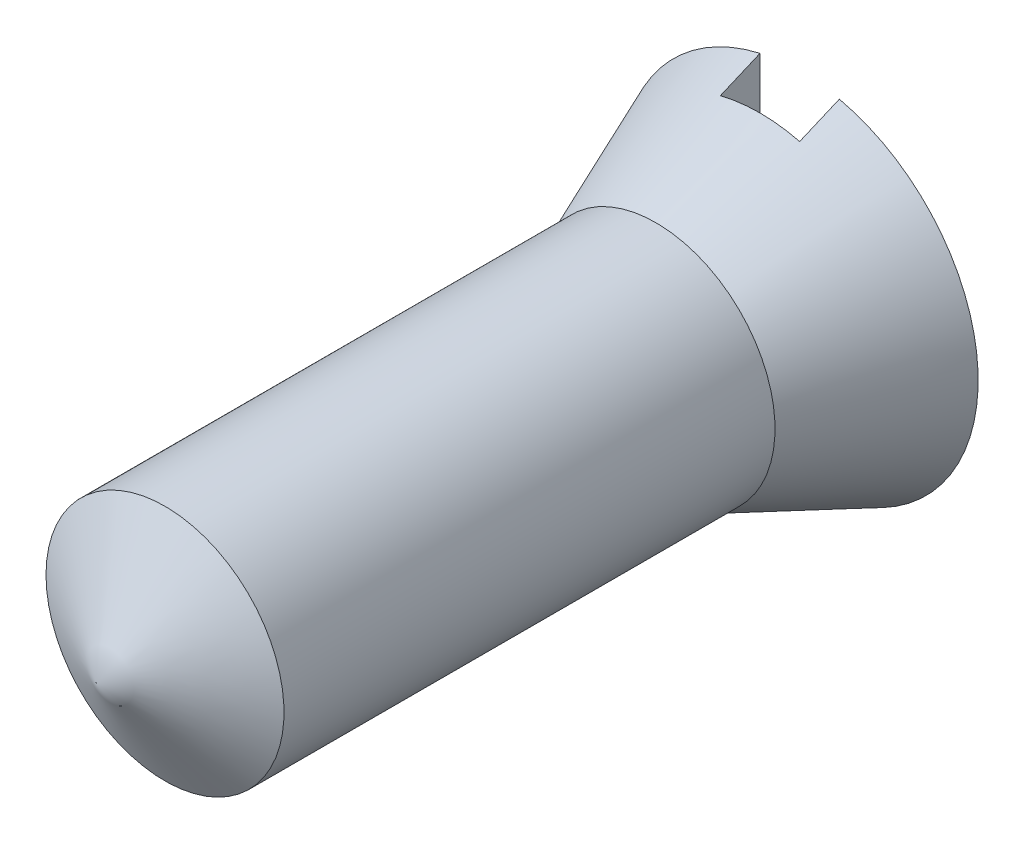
ISO-10303-21;
HEADER;
FILE_DESCRIPTION(('STEP AP214'),'2;1');
FILE_NAME('part.step','',(''),(''),'','','');
FILE_SCHEMA(('AUTOMOTIVE_DESIGN { 1 0 10303 214 1 1 1 1 }'));
ENDSEC;
DATA;
#1=APPLICATION_CONTEXT('core data for automotive mechanical design processes');
#2=APPLICATION_PROTOCOL_DEFINITION('international standard','automotive_design',2000,#1);
#3=PRODUCT_CONTEXT('',#1,'mechanical');
#4=PRODUCT('Part','Part','',(#3));
#5=PRODUCT_RELATED_PRODUCT_CATEGORY('part','',(#4));
#6=PRODUCT_DEFINITION_FORMATION('','',#4);
#7=PRODUCT_DEFINITION_CONTEXT('part definition',#1,'design');
#8=PRODUCT_DEFINITION('design','',#6,#7);
#9=PRODUCT_DEFINITION_SHAPE('','',#8);
#10=(LENGTH_UNIT() NAMED_UNIT(*) SI_UNIT(.MILLI.,.METRE.));
#11=(NAMED_UNIT(*) PLANE_ANGLE_UNIT() SI_UNIT($,.RADIAN.));
#12=(NAMED_UNIT(*) SI_UNIT($,.STERADIAN.) SOLID_ANGLE_UNIT());
#13=UNCERTAINTY_MEASURE_WITH_UNIT(LENGTH_MEASURE(1.E-05),#10,'distance_accuracy_value','');
#14=(GEOMETRIC_REPRESENTATION_CONTEXT(3) GLOBAL_UNCERTAINTY_ASSIGNED_CONTEXT((#13)) GLOBAL_UNIT_ASSIGNED_CONTEXT((#10,
#11,#12)) REPRESENTATION_CONTEXT('',''));
#15=CARTESIAN_POINT('',(0.,0.,0.));
#16=DIRECTION('',(0.,0.,1.));
#17=DIRECTION('',(1.,0.,0.));
#18=AXIS2_PLACEMENT_3D('',#15,#16,#17);
#19=CARTESIAN_POINT('',(0.,0.,-17.7320508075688));
#20=DIRECTION('',(0.,0.,0.999999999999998));
#21=DIRECTION('',(1.,0.,0.));
#22=AXIS2_PLACEMENT_3D('',#19,#20,#21);
#23=PLANE('',#22);
#24=CARTESIAN_POINT('',(0.,0.,-17.7320508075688));
#25=DIRECTION('',(0.,0.,-0.999999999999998));
#26=DIRECTION('',(-1.,0.,0.));
#27=AXIS2_PLACEMENT_3D('',#24,#25,#26);
#28=CIRCLE('',#27,4.5);
#29=CARTESIAN_POINT('',(-1.00000000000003,-4.38748219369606,-17.7320508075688));
#30=VERTEX_POINT('',#29);
#31=CARTESIAN_POINT('',(-1.00000000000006,4.38748219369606,-17.7320508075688));
#32=VERTEX_POINT('',#31);
#33=EDGE_CURVE('E94',#30,#32,#28,.T.);
#34=ORIENTED_EDGE('',*,*,#33,.T.);
#35=DIRECTION('',(0.,1.,0.));
#36=VECTOR('',#35,1.);
#37=CARTESIAN_POINT('',(-1.00000000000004,-5.22642009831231,-17.7320508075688));
#38=LINE('',#37,#36);
#39=EDGE_CURVE('E83',#30,#32,#38,.T.);
#40=ORIENTED_EDGE('',*,*,#39,.F.);
#41=EDGE_LOOP('',(#34,#40));
#42=FACE_BOUND('',#41,.T.);
#43=ADVANCED_FACE('F34',(#42),#23,.F.);
#44=CARTESIAN_POINT('',(0.,0.,0.));
#45=DIRECTION('',(0.,0.,-0.999999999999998));
#46=DIRECTION('',(-1.,0.,0.));
#47=AXIS2_PLACEMENT_3D('',#44,#45,#46);
#48=CONICAL_SURFACE('',#47,0.,1.0471975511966);
#49=CARTESIAN_POINT('',(0.,0.,-1.73205080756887));
#50=DIRECTION('',(0.,0.,-0.999999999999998));
#51=DIRECTION('',(-1.,0.,0.));
#52=AXIS2_PLACEMENT_3D('',#49,#50,#51);
#53=CIRCLE('',#52,3.);
#54=CARTESIAN_POINT('',(-3.,0.,-1.73205080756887));
#55=VERTEX_POINT('',#54);
#56=EDGE_CURVE('E106',#55,#55,#53,.T.);
#57=ORIENTED_EDGE('',*,*,#56,.F.);
#58=EDGE_LOOP('',(#57));
#59=FACE_BOUND('',#58,.T.);
#60=CARTESIAN_POINT('',(0.,0.,0.));
#61=VERTEX_POINT('',#60);
#62=VERTEX_LOOP('',#61);
#63=FACE_BOUND('',#62,.T.);
#64=ADVANCED_FACE('F36',(#59,#63),#48,.T.);
#65=CARTESIAN_POINT('',(0.99999999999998,4.38748219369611,-17.7320508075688));
#66=VERTEX_POINT('',#65);
#67=CARTESIAN_POINT('',(1.,-4.38748219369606,-17.7320508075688));
#68=VERTEX_POINT('',#67);
#69=EDGE_CURVE('E100',#66,#68,#28,.T.);
#70=ORIENTED_EDGE('',*,*,#69,.T.);
#71=DIRECTION('',(0.,-1.,0.));
#72=VECTOR('',#71,1.);
#73=CARTESIAN_POINT('',(0.999999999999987,-5.22642009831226,-17.7320508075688));
#74=LINE('',#73,#72);
#75=EDGE_CURVE('E95',#66,#68,#74,.T.);
#76=ORIENTED_EDGE('',*,*,#75,.F.);
#77=EDGE_LOOP('',(#70,#76));
#78=FACE_BOUND('',#77,.T.);
#79=ADVANCED_FACE('F140',(#78),#23,.F.);
#80=CARTESIAN_POINT('',(0.,0.,-14.1107304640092));
#81=DIRECTION('',(0.,0.,-0.999999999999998));
#82=DIRECTION('',(-1.,0.,0.));
#83=AXIS2_PLACEMENT_3D('',#80,#81,#82);
#84=CONICAL_SURFACE('',#83,3.,0.392699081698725);
#85=CARTESIAN_POINT('',(0.,0.,-16.7320508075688));
#86=DIRECTION('',(0.,0.,0.999999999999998));
#87=DIRECTION('',(1.,0.,0.));
#88=AXIS2_PLACEMENT_3D('',#85,#86,#87);
#89=CIRCLE('',#88,4.0857864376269);
#90=CARTESIAN_POINT('',(0.999999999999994,3.96152127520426,-16.7320508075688));
#91=VERTEX_POINT('',#90);
#92=CARTESIAN_POINT('',(-1.00000000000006,3.96152127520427,-16.7320508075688));
#93=VERTEX_POINT('',#92);
#94=EDGE_CURVE('E89',#91,#93,#89,.T.);
#95=ORIENTED_EDGE('',*,*,#94,.T.);
#96=CARTESIAN_POINT('',(-1.00000000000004,1.60063772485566,-11.4245244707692));
#97=CARTESIAN_POINT('',(-1.00000000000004,1.65057142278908,-11.5267897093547));
#98=CARTESIAN_POINT('',(-1.00000000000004,1.69999701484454,-11.6293007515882));
#99=CARTESIAN_POINT('',(-1.00000000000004,1.79801494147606,-11.8347179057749));
#100=CARTESIAN_POINT('',(-1.00000000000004,1.84660729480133,-11.9376240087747));
#101=CARTESIAN_POINT('',(-1.00000000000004,1.99140591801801,-12.2467835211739));
#102=CARTESIAN_POINT('',(-1.00000000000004,2.08664025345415,-12.4534915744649));
#103=CARTESIAN_POINT('',(-1.00000000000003,2.27536549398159,-12.8676670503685));
#104=CARTESIAN_POINT('',(-1.00000000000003,2.36885661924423,-13.0751343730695));
#105=CARTESIAN_POINT('',(-1.00000000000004,2.55461331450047,-13.4906213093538));
#106=CARTESIAN_POINT('',(-1.00000000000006,2.64687885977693,-13.6986409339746));
#107=CARTESIAN_POINT('',(-1.00000000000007,2.84981541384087,-14.1588520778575));
#108=CARTESIAN_POINT('',(-1.00000000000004,2.96027771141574,-14.4111355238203));
#109=CARTESIAN_POINT('',(-1.00000000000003,3.18025742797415,-14.9161114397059));
#110=CARTESIAN_POINT('',(-1.00000000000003,3.28977485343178,-15.168803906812));
#111=CARTESIAN_POINT('',(-1.00000000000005,3.61730866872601,-15.9273692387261));
#112=CARTESIAN_POINT('',(-1.00000000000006,3.83428875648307,-16.4336893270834));
#113=CARTESIAN_POINT('',(-1.00000000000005,4.24781720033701,-17.4029614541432));
#114=CARTESIAN_POINT('',(-1.00000000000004,4.44450138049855,-17.8658556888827));
#115=CARTESIAN_POINT('',(-1.00000000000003,4.83694417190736,-18.7920365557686));
#116=CARTESIAN_POINT('',(-1.00000000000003,5.03270278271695,-19.2553231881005));
#117=CARTESIAN_POINT('',(-1.00000000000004,5.4235382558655,-20.1820819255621));
#118=CARTESIAN_POINT('',(-1.00000000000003,5.61861523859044,-20.6455539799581));
#119=CARTESIAN_POINT('',(-1.00000000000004,6.00828539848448,-21.5727001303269));
#120=CARTESIAN_POINT('',(-1.00000000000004,6.2028785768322,-22.0363742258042));
#121=CARTESIAN_POINT('',(-1.00000000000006,6.39731094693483,-22.5001155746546));
#122=B_SPLINE_CURVE_WITH_KNOTS('',3,(#96,#97,#98,#99,#100,#101,#102,#103,#104,#105,#106,#107,
#108,#109,#110,#111,#112,#113,#114,#115,#116,#117,#118,#119,#120,#121),.UNSPECIFIED.,.F.,.F.,(4,
2,2,2,2,2,2,2,2,2,2,2,4),(0.,0.341410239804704,0.682812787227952,1.36557309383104,
2.04824657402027,2.73093380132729,3.55715118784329,4.38336290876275,6.03591968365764,
7.54475991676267,9.05360086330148,10.5621602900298,12.0707160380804),.UNSPECIFIED.);
#123=EDGE_CURVE('E11',#93,#32,#122,.T.);
#124=ORIENTED_EDGE('',*,*,#123,.T.);
#125=ORIENTED_EDGE('',*,*,#33,.F.);
#126=CARTESIAN_POINT('',(-1.,-6.39731094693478,-22.5001155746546));
#127=CARTESIAN_POINT('',(-1.00000000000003,-6.20285005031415,-22.0363065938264));
#128=CARTESIAN_POINT('',(-1.00000000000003,-6.00822851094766,-21.5725647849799));
#129=CARTESIAN_POINT('',(-1.00000000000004,-5.61850468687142,-20.6452909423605));
#130=CARTESIAN_POINT('',(-1.00000000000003,-5.4234024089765,-20.181758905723));
#131=CARTESIAN_POINT('',(-1.00000000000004,-5.03256941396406,-19.2550078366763));
#132=CARTESIAN_POINT('',(-1.00000000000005,-4.8368387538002,-18.7917887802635));
#133=CARTESIAN_POINT('',(-1.00000000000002,-4.44445071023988,-17.8657350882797));
#134=CARTESIAN_POINT('',(-0.999999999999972,-4.24779331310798,-17.4029004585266));
#135=CARTESIAN_POINT('',(-0.999999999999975,-3.85308326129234,-16.4777469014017));
#136=CARTESIAN_POINT('',(-1.00000000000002,-3.65503041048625,-16.0154280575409));
#137=CARTESIAN_POINT('',(-1.00000000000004,-3.3563030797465,-15.3226703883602));
#138=CARTESIAN_POINT('',(-1.00000000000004,-3.25645449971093,-15.0918755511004));
#139=CARTESIAN_POINT('',(-1.00000000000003,-3.0560290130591,-14.6305998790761));
#140=CARTESIAN_POINT('',(-1.00000000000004,-2.95545210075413,-14.4001190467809));
#141=CARTESIAN_POINT('',(-1.00000000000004,-2.75331074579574,-13.939552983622));
#142=CARTESIAN_POINT('',(-1.00000000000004,-2.65174617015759,-13.7094678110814));
#143=CARTESIAN_POINT('',(-1.00000000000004,-2.44727167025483,-13.2499002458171));
#144=CARTESIAN_POINT('',(-1.00000000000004,-2.3443617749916,-13.020417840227));
#145=CARTESIAN_POINT('',(-1.00000000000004,-2.18851526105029,-12.6768478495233));
#146=CARTESIAN_POINT('',(-1.00000000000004,-2.136315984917,-12.5624259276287));
#147=CARTESIAN_POINT('',(-1.00000000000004,-2.03130559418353,-12.3338640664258));
#148=CARTESIAN_POINT('',(-1.00000000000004,-1.97849448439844,-12.2197241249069));
#149=CARTESIAN_POINT('',(-1.00000000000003,-1.87210843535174,-11.9917897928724));
#150=CARTESIAN_POINT('',(-1.00000000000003,-1.81853344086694,-11.8779954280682));
#151=CARTESIAN_POINT('',(-1.00000000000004,-1.71038916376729,-11.650876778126));
#152=CARTESIAN_POINT('',(-1.00000000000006,-1.65581985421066,-11.5375525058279));
#153=CARTESIAN_POINT('',(-1.00000000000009,-1.60063772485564,-11.4245244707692));
#154=B_SPLINE_CURVE_WITH_KNOTS('',3,(#126,#127,#128,#129,#130,#131,#132,#133,#134,#135,#136,
#137,#138,#139,#140,#141,#142,#143,#144,#145,#146,#147,#148,#149,#150,#151,#152,#153),
.UNSPECIFIED.,.F.,.F.,(4,2,2,2,2,2,2,2,2,2,2,2,2,4),(0.,1.50877597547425,3.01753068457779,
4.52615230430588,6.03479635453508,7.5436568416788,8.29805902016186,9.05246709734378,
9.80697819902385,10.561473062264,10.9387702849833,11.3160645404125,11.6933862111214,
12.0707181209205),.UNSPECIFIED.);
#155=CARTESIAN_POINT('',(-1.00000000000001,-3.96152127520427,-16.7320508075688));
#156=VERTEX_POINT('',#155);
#157=EDGE_CURVE('E80',#30,#156,#154,.T.);
#158=ORIENTED_EDGE('',*,*,#157,.T.);
#159=CARTESIAN_POINT('',(0.999999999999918,-3.96152127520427,-16.7320508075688));
#160=VERTEX_POINT('',#159);
#161=EDGE_CURVE('E104',#156,#160,#89,.T.);
#162=ORIENTED_EDGE('',*,*,#161,.T.);
#163=CARTESIAN_POINT('',(0.999999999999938,-1.60063772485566,-11.4245244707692));
#164=CARTESIAN_POINT('',(0.999999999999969,-1.6505714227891,-11.5267897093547));
#165=CARTESIAN_POINT('',(0.999999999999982,-1.69999701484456,-11.6293007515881));
#166=CARTESIAN_POINT('',(0.999999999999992,-1.79801494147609,-11.8347179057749));
#167=CARTESIAN_POINT('',(0.999999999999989,-1.84660729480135,-11.9376240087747));
#168=CARTESIAN_POINT('',(0.999999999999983,-1.99140591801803,-12.2467835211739));
#169=CARTESIAN_POINT('',(0.999999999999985,-2.08664025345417,-12.4534915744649));
#170=CARTESIAN_POINT('',(0.999999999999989,-2.27536549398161,-12.8676670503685));
#171=CARTESIAN_POINT('',(0.999999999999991,-2.36885661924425,-13.0751343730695));
#172=CARTESIAN_POINT('',(0.999999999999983,-2.55461331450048,-13.4906213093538));
#173=CARTESIAN_POINT('',(0.999999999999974,-2.64687885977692,-13.6986409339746));
#174=CARTESIAN_POINT('',(0.999999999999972,-2.84981541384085,-14.1588520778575));
#175=CARTESIAN_POINT('',(0.999999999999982,-2.96027771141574,-14.4111355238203));
#176=CARTESIAN_POINT('',(0.999999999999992,-3.18025742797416,-14.9161114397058));
#177=CARTESIAN_POINT('',(0.99999999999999,-3.28977485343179,-15.168803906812));
#178=CARTESIAN_POINT('',(0.999999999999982,-3.617308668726,-15.9273692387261));
#179=CARTESIAN_POINT('',(0.999999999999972,-3.83428875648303,-16.4336893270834));
#180=CARTESIAN_POINT('',(0.999999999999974,-4.24781720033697,-17.4029614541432));
#181=CARTESIAN_POINT('',(0.999999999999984,-4.44450138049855,-17.8658556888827));
#182=CARTESIAN_POINT('',(0.99999999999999,-4.83694417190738,-18.7920365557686));
#183=CARTESIAN_POINT('',(0.999999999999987,-5.03270278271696,-19.2553231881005));
#184=CARTESIAN_POINT('',(0.999999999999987,-5.4235382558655,-20.1820819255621));
#185=CARTESIAN_POINT('',(0.999999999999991,-5.61861523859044,-20.6455539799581));
#186=CARTESIAN_POINT('',(0.999999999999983,-6.00828539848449,-21.5727001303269));
#187=CARTESIAN_POINT('',(0.999999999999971,-6.20287857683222,-22.0363742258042));
#188=CARTESIAN_POINT('',(0.999999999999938,-6.39731094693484,-22.5001155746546));
#189=B_SPLINE_CURVE_WITH_KNOTS('',3,(#163,#164,#165,#166,#167,#168,#169,#170,#171,#172,#173,
#174,#175,#176,#177,#178,#179,#180,#181,#182,#183,#184,#185,#186,#187,#188),.UNSPECIFIED.,.F.,
.F.,(4,2,2,2,2,2,2,2,2,2,2,2,4),(0.,0.341410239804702,0.68281278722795,1.36557309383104,
2.04824657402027,2.73093380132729,3.55715118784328,4.38336290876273,6.03591968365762,
7.54475991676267,9.05360086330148,10.5621602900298,12.0707160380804),.UNSPECIFIED.);
#190=EDGE_CURVE('E90',#160,#68,#189,.T.);
#191=ORIENTED_EDGE('',*,*,#190,.T.);
#192=ORIENTED_EDGE('',*,*,#69,.F.);
#193=CARTESIAN_POINT('',(0.999999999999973,6.39731094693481,-22.5001155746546));
#194=CARTESIAN_POINT('',(0.999999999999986,6.20285005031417,-22.0363065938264));
#195=CARTESIAN_POINT('',(0.999999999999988,6.00822851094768,-21.5725647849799));
#196=CARTESIAN_POINT('',(0.999999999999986,5.61850468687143,-20.6452909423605));
#197=CARTESIAN_POINT('',(0.999999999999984,5.42340240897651,-20.181758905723));
#198=CARTESIAN_POINT('',(0.99999999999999,5.03256941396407,-19.2550078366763));
#199=CARTESIAN_POINT('',(1.,4.83683875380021,-18.7917887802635));
#200=CARTESIAN_POINT('',(0.999999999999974,4.44445071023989,-17.8657350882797));
#201=CARTESIAN_POINT('',(0.999999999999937,4.247793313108,-17.4029004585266));
#202=CARTESIAN_POINT('',(0.999999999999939,3.85308326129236,-16.4777469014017));
#203=CARTESIAN_POINT('',(0.999999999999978,3.65503041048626,-16.0154280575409));
#204=CARTESIAN_POINT('',(0.999999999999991,3.35630307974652,-15.3226703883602));
#205=CARTESIAN_POINT('',(0.999999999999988,3.25645449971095,-15.0918755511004));
#206=CARTESIAN_POINT('',(0.999999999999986,3.05602901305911,-14.6305998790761));
#207=CARTESIAN_POINT('',(0.999999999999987,2.95545210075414,-14.4001190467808));
#208=CARTESIAN_POINT('',(0.999999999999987,2.75331074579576,-13.939552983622));
#209=CARTESIAN_POINT('',(0.999999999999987,2.6517461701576,-13.7094678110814));
#210=CARTESIAN_POINT('',(0.999999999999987,2.44727167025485,-13.2499002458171));
#211=CARTESIAN_POINT('',(0.999999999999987,2.34436177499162,-13.020417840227));
#212=CARTESIAN_POINT('',(0.999999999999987,2.18851526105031,-12.6768478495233));
#213=CARTESIAN_POINT('',(0.999999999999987,2.13631598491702,-12.5624259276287));
#214=CARTESIAN_POINT('',(0.999999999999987,2.03130559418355,-12.3338640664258));
#215=CARTESIAN_POINT('',(0.999999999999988,1.97849448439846,-12.2197241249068));
#216=CARTESIAN_POINT('',(0.999999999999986,1.87210843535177,-11.9917897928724));
#217=CARTESIAN_POINT('',(0.999999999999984,1.81853344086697,-11.8779954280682));
#218=CARTESIAN_POINT('',(0.99999999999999,1.71038916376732,-11.650876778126));
#219=CARTESIAN_POINT('',(0.999999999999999,1.65581985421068,-11.5375525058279));
#220=CARTESIAN_POINT('',(1.00000000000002,1.60063772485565,-11.4245244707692));
#221=B_SPLINE_CURVE_WITH_KNOTS('',3,(#193,#194,#195,#196,#197,#198,#199,#200,#201,#202,#203,
#204,#205,#206,#207,#208,#209,#210,#211,#212,#213,#214,#215,#216,#217,#218,#219,#220),
.UNSPECIFIED.,.F.,.F.,(4,2,2,2,2,2,2,2,2,2,2,2,2,4),(0.,1.50877597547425,3.0175306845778,
4.52615230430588,6.03479635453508,7.54365684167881,8.29805902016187,9.05246709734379,
9.80697819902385,10.561473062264,10.9387702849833,11.3160645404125,11.6933862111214,
12.0707181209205),.UNSPECIFIED.);
#222=EDGE_CURVE('E47',#66,#91,#221,.T.);
#223=ORIENTED_EDGE('',*,*,#222,.T.);
#224=EDGE_LOOP('',(#95,#124,#125,#158,#162,#191,#192,#223));
#225=FACE_BOUND('',#224,.T.);
#226=CARTESIAN_POINT('',(0.,0.,-14.1107304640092));
#227=DIRECTION('',(0.,0.,-0.999999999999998));
#228=DIRECTION('',(-1.,0.,0.));
#229=AXIS2_PLACEMENT_3D('',#226,#227,#228);
#230=CIRCLE('',#229,3.);
#231=CARTESIAN_POINT('',(-3.,0.,-14.1107304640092));
#232=VERTEX_POINT('',#231);
#233=EDGE_CURVE('E101',#232,#232,#230,.T.);
#234=ORIENTED_EDGE('',*,*,#233,.T.);
#235=EDGE_LOOP('',(#234));
#236=FACE_BOUND('',#235,.T.);
#237=ADVANCED_FACE('F98',(#225,#236),#84,.T.);
#238=CARTESIAN_POINT('',(0.,0.,0.));
#239=DIRECTION('',(0.,0.,-0.999999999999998));
#240=DIRECTION('',(-1.,0.,0.));
#241=AXIS2_PLACEMENT_3D('',#238,#239,#240);
#242=CYLINDRICAL_SURFACE('',#241,3.);
#243=CARTESIAN_POINT('',(-3.,0.,-14.1107304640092));
#244=CARTESIAN_POINT('',(-3.,0.,-13.9817858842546));
#245=CARTESIAN_POINT('',(-3.,0.,-13.8528413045));
#246=CARTESIAN_POINT('',(-3.,0.,-13.5949521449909));
#247=CARTESIAN_POINT('',(-3.,0.,-13.4660075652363));
#248=CARTESIAN_POINT('',(-3.,0.,-13.2081184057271));
#249=CARTESIAN_POINT('',(-3.,0.,-13.0791738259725));
#250=CARTESIAN_POINT('',(-3.,0.,-12.8212846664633));
#251=CARTESIAN_POINT('',(-3.,0.,-12.6923400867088));
#252=CARTESIAN_POINT('',(-3.,0.,-12.4344509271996));
#253=CARTESIAN_POINT('',(-3.,0.,-12.305506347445));
#254=CARTESIAN_POINT('',(-3.,0.,-12.0476171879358));
#255=CARTESIAN_POINT('',(-3.,0.,-11.9186726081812));
#256=CARTESIAN_POINT('',(-3.,0.,-11.6607834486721));
#257=CARTESIAN_POINT('',(-3.,0.,-11.5318388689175));
#258=CARTESIAN_POINT('',(-3.,0.,-11.2739497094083));
#259=CARTESIAN_POINT('',(-3.,0.,-11.1450051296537));
#260=CARTESIAN_POINT('',(-3.,0.,-10.8871159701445));
#261=CARTESIAN_POINT('',(-3.,0.,-10.7581713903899));
#262=CARTESIAN_POINT('',(-3.,0.,-10.5002822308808));
#263=CARTESIAN_POINT('',(-3.,0.,-10.3713376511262));
#264=CARTESIAN_POINT('',(-3.,0.,-10.113448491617));
#265=CARTESIAN_POINT('',(-3.,0.,-9.98450391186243));
#266=CARTESIAN_POINT('',(-3.,0.,-9.72661475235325));
#267=CARTESIAN_POINT('',(-3.,0.,-9.59767017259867));
#268=CARTESIAN_POINT('',(-3.,0.,-9.33978101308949));
#269=CARTESIAN_POINT('',(-3.,0.,-9.21083643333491));
#270=CARTESIAN_POINT('',(-3.,0.,-8.95294727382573));
#271=CARTESIAN_POINT('',(-3.,0.,-8.82400269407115));
#272=CARTESIAN_POINT('',(-3.,0.,-8.56611353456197));
#273=CARTESIAN_POINT('',(-3.,0.,-8.43716895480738));
#274=CARTESIAN_POINT('',(-3.,0.,-8.17927979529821));
#275=CARTESIAN_POINT('',(-3.,0.,-8.05033521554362));
#276=CARTESIAN_POINT('',(-3.,0.,-7.79244605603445));
#277=CARTESIAN_POINT('',(-3.,0.,-7.66350147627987));
#278=CARTESIAN_POINT('',(-3.,0.,-7.40561231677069));
#279=CARTESIAN_POINT('',(-3.,0.,-7.2766677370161));
#280=CARTESIAN_POINT('',(-3.,0.,-7.01877857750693));
#281=CARTESIAN_POINT('',(-3.,0.,-6.88983399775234));
#282=CARTESIAN_POINT('',(-3.,0.,-6.63194483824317));
#283=CARTESIAN_POINT('',(-3.,0.,-6.50300025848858));
#284=CARTESIAN_POINT('',(-3.,0.,-6.24511109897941));
#285=CARTESIAN_POINT('',(-3.,0.,-6.11616651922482));
#286=CARTESIAN_POINT('',(-3.,0.,-5.85827735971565));
#287=CARTESIAN_POINT('',(-3.,0.,-5.72933277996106));
#288=CARTESIAN_POINT('',(-3.,0.,-5.47144362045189));
#289=CARTESIAN_POINT('',(-3.,0.,-5.3424990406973));
#290=CARTESIAN_POINT('',(-3.,0.,-5.08460988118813));
#291=CARTESIAN_POINT('',(-3.,0.,-4.95566530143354));
#292=CARTESIAN_POINT('',(-3.,0.,-4.69777614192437));
#293=CARTESIAN_POINT('',(-3.,0.,-4.56883156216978));
#294=CARTESIAN_POINT('',(-3.,0.,-4.31094240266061));
#295=CARTESIAN_POINT('',(-3.,0.,-4.18199782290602));
#296=CARTESIAN_POINT('',(-3.,0.,-3.92410866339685));
#297=CARTESIAN_POINT('',(-3.,0.,-3.79516408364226));
#298=CARTESIAN_POINT('',(-3.,0.,-3.53727492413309));
#299=CARTESIAN_POINT('',(-3.,0.,-3.4083303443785));
#300=CARTESIAN_POINT('',(-3.,0.,-3.15044118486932));
#301=CARTESIAN_POINT('',(-3.,0.,-3.02149660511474));
#302=CARTESIAN_POINT('',(-3.,0.,-2.76360744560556));
#303=CARTESIAN_POINT('',(-3.,0.,-2.63466286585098));
#304=CARTESIAN_POINT('',(-3.,0.,-2.3767737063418));
#305=CARTESIAN_POINT('',(-3.,0.,-2.24782912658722));
#306=CARTESIAN_POINT('',(-3.,0.,-1.98993996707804));
#307=CARTESIAN_POINT('',(-3.,0.,-1.86099538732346));
#308=CARTESIAN_POINT('',(-3.,0.,-1.73205080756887));
#309=B_SPLINE_CURVE_WITH_KNOTS('',3,(#243,#244,#245,#246,#247,#248,#249,#250,#251,#252,#253,
#254,#255,#256,#257,#258,#259,#260,#261,#262,#263,#264,#265,#266,#267,#268,#269,#270,#271,#272,
#273,#274,#275,#276,#277,#278,#279,#280,#281,#282,#283,#284,#285,#286,#287,#288,#289,#290,#291,
#292,#293,#294,#295,#296,#297,#298,#299,#300,#301,#302,#303,#304,#305,#306,#307,#308),
.UNSPECIFIED.,.F.,.F.,(4,2,2,2,2,2,2,2,2,2,2,2,2,2,2,2,2,2,2,2,2,2,2,2,2,2,2,2,2,2,2,2,4),(0.,
0.386833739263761,0.773667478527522,1.16050121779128,1.54733495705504,1.9341686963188,
2.32100243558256,2.70783617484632,3.09466991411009,3.48150365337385,3.86833739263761,
4.25517113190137,4.64200487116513,5.02883861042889,5.41567234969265,5.80250608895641,
6.18933982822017,6.57617356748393,6.96300730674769,7.34984104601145,7.73667478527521,
8.12350852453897,8.51034226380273,8.89717600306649,9.28400974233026,9.67084348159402,
10.0576772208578,10.4445109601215,10.8313446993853,11.2181784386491,11.6050121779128,
11.9918459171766,12.3786796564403),.UNSPECIFIED.);
#310=EDGE_CURVE('BSEAM146',#232,#55,#309,.T.);
#311=ORIENTED_EDGE('',*,*,#233,.F.);
#312=ORIENTED_EDGE('',*,*,#56,.T.);
#313=ORIENTED_EDGE('',*,*,#310,.T.);
#314=ORIENTED_EDGE('',*,*,#310,.F.);
#315=EDGE_LOOP('',(#311,#313,#312,#314));
#316=FACE_BOUND('',#315,.T.);
#317=ADVANCED_FACE('F146',(#316),#242,.T.);
#318=CARTESIAN_POINT('',(-1.00000000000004,-5.22642009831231,-16.7320508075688));
#319=DIRECTION('',(-1.,0.,0.));
#320=DIRECTION('',(0.,0.,0.999999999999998));
#321=AXIS2_PLACEMENT_3D('',#318,#319,#320);
#322=PLANE('',#321);
#323=ORIENTED_EDGE('',*,*,#39,.T.);
#324=ORIENTED_EDGE('',*,*,#123,.F.);
#325=DIRECTION('',(0.,1.,0.));
#326=VECTOR('',#325,1.);
#327=CARTESIAN_POINT('',(-1.00000000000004,-5.22642009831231,-16.7320508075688));
#328=LINE('',#327,#326);
#329=EDGE_CURVE('E85',#156,#93,#328,.T.);
#330=ORIENTED_EDGE('',*,*,#329,.F.);
#331=ORIENTED_EDGE('',*,*,#157,.F.);
#332=EDGE_LOOP('',(#323,#324,#330,#331));
#333=FACE_BOUND('',#332,.T.);
#334=ADVANCED_FACE('F82',(#333),#322,.F.);
#335=CARTESIAN_POINT('',(0.999999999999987,-5.22642009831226,-16.7320508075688));
#336=DIRECTION('',(1.,0.,0.));
#337=DIRECTION('',(0.,0.,-0.999999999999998));
#338=AXIS2_PLACEMENT_3D('',#335,#336,#337);
#339=PLANE('',#338);
#340=DIRECTION('',(0.,-1.,0.));
#341=VECTOR('',#340,1.);
#342=CARTESIAN_POINT('',(0.999999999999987,-5.22642009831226,-16.7320508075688));
#343=LINE('',#342,#341);
#344=EDGE_CURVE('E54',#91,#160,#343,.T.);
#345=ORIENTED_EDGE('',*,*,#344,.F.);
#346=ORIENTED_EDGE('',*,*,#222,.F.);
#347=ORIENTED_EDGE('',*,*,#75,.T.);
#348=ORIENTED_EDGE('',*,*,#190,.F.);
#349=EDGE_LOOP('',(#345,#346,#347,#348));
#350=FACE_BOUND('',#349,.T.);
#351=ADVANCED_FACE('F121',(#350),#339,.F.);
#352=CARTESIAN_POINT('',(-1.00000000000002,5.22642009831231,-16.7320508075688));
#353=DIRECTION('',(0.,0.,0.999999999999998));
#354=DIRECTION('',(1.,0.,0.));
#355=AXIS2_PLACEMENT_3D('',#352,#353,#354);
#356=PLANE('',#355);
#357=ORIENTED_EDGE('',*,*,#344,.T.);
#358=ORIENTED_EDGE('',*,*,#161,.F.);
#359=ORIENTED_EDGE('',*,*,#329,.T.);
#360=ORIENTED_EDGE('',*,*,#94,.F.);
#361=EDGE_LOOP('',(#357,#358,#359,#360));
#362=FACE_BOUND('',#361,.T.);
#363=ADVANCED_FACE('F125',(#362),#356,.F.);
#364=CLOSED_SHELL('',(#43,#64,#79,#237,#317,#334,#351,#363));
#365=MANIFOLD_SOLID_BREP('B2',#364);
#366=ADVANCED_BREP_SHAPE_REPRESENTATION('',(#18,#365),#14);
#367=SHAPE_DEFINITION_REPRESENTATION(#9,#366);
ENDSEC;
END-ISO-10303-21;
